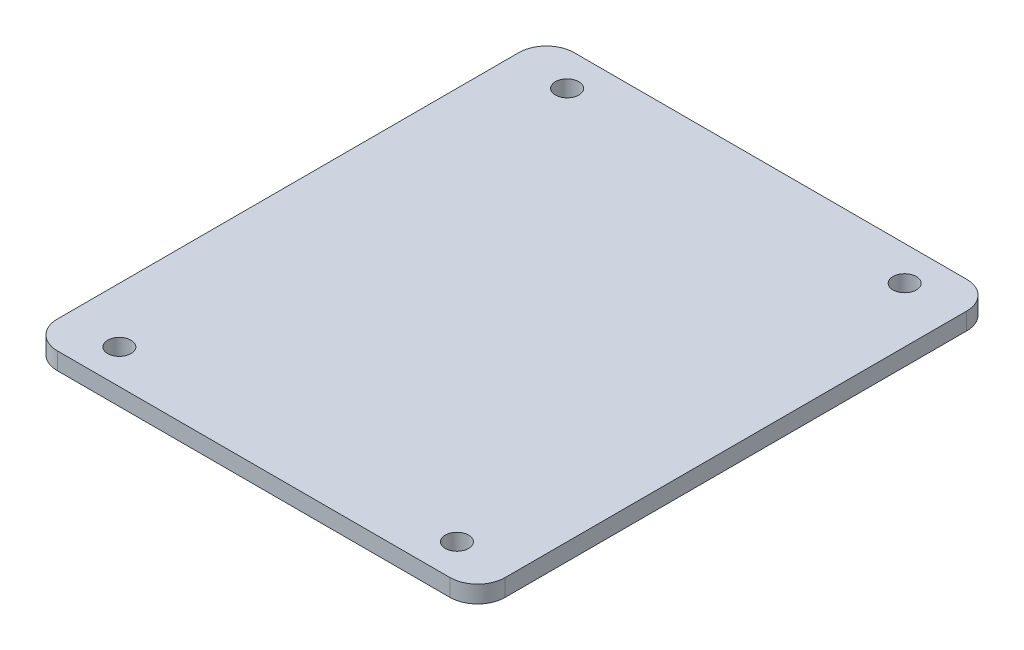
from build123d import *

# Parameters (mm, degrees)
SKETCH1_W             = 82.55
SKETCH1_H             = 95.25
MAIN_EXTRUSION_DEPTH  = 3.175
SKETCH2_R             = 2.15
STAND_OFF_HOLES_DEPTH = 64.101876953
FILLET1_R             = 5.08


with BuildPart() as part:
    # Sketch1 → Main Extrusion (new body)
    with BuildSketch(Plane(origin=(0, 0, 0), x_dir=(1, 0, 0), z_dir=(0, 1, 0))):
        Rectangle(SKETCH1_W, SKETCH1_H)
    extrude(amount=MAIN_EXTRUSION_DEPTH)

    # Sketch2 → Stand off holes (cut, through all)
    with BuildSketch(Plane(origin=(0, 0, 0), x_dir=(-1, 0, 0), z_dir=(0, -1, 0))):
        with Locations(Location((-31.115, -41.275, 0), (0, 0, 90))):
            Circle(SKETCH2_R)
        with Locations(Location((-31.115, 41.275, 0), (0, 0, 90))):
            Circle(SKETCH2_R)
        with Locations(Location((31.115, 41.275, 0), (0, 0, 90))):
            Circle(SKETCH2_R)
        with Locations(Location((31.115, -41.275, 0), (0, 0, 90))):
            Circle(SKETCH2_R)
    extrude(amount=-STAND_OFF_HOLES_DEPTH, mode=Mode.SUBTRACT)

    # Fillet1
    fillet1_edges = [part.edges().sort_by_distance(p)[0] for p in [
        (-41.275, 1.5875, -47.625),
        (41.275, 1.5875, -47.625),
        (41.275, 1.5875, 47.625),
        (-41.275, 1.5875, 47.625),
    ]]
    fillet(fillet1_edges, radius=FILLET1_R)


solid = part.part
